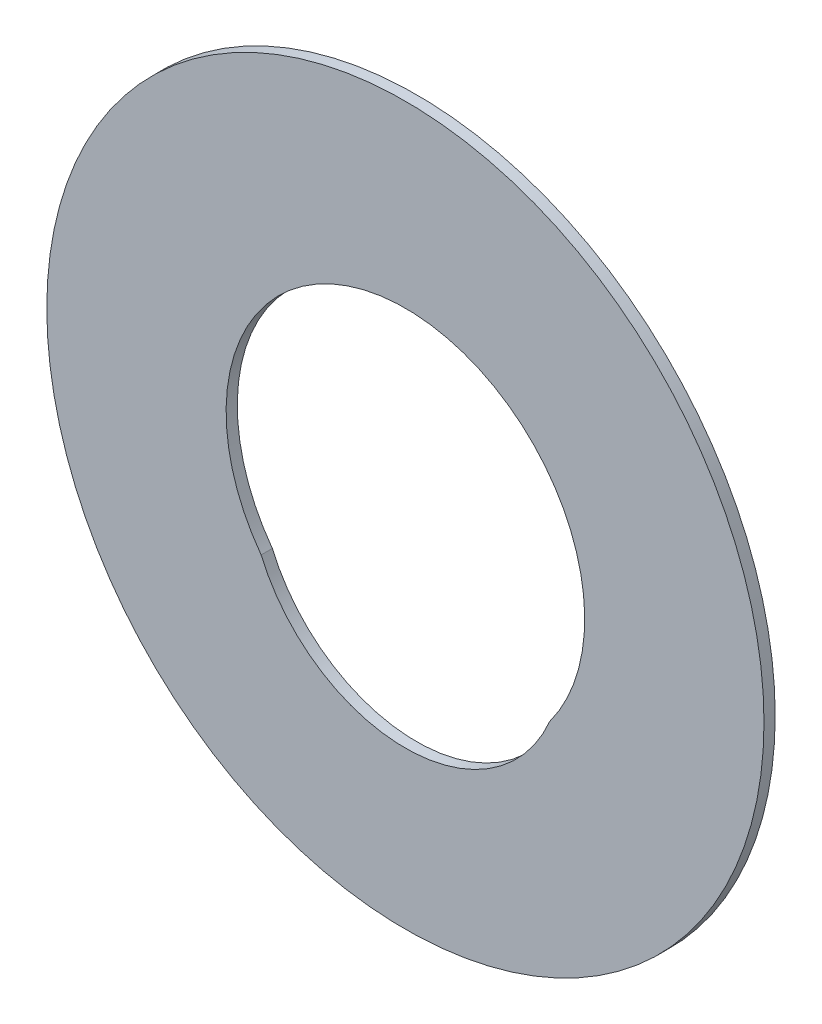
ISO-10303-21;
HEADER;
FILE_DESCRIPTION(('STEP AP214'),'2;1');
FILE_NAME('part.step','',(''),(''),'','','');
FILE_SCHEMA(('AUTOMOTIVE_DESIGN { 1 0 10303 214 1 1 1 1 }'));
ENDSEC;
DATA;
#1=APPLICATION_CONTEXT('core data for automotive mechanical design processes');
#2=APPLICATION_PROTOCOL_DEFINITION('international standard','automotive_design',2000,#1);
#3=PRODUCT_CONTEXT('',#1,'mechanical');
#4=PRODUCT('Part','Part','',(#3));
#5=PRODUCT_RELATED_PRODUCT_CATEGORY('part','',(#4));
#6=PRODUCT_DEFINITION_FORMATION('','',#4);
#7=PRODUCT_DEFINITION_CONTEXT('part definition',#1,'design');
#8=PRODUCT_DEFINITION('design','',#6,#7);
#9=PRODUCT_DEFINITION_SHAPE('','',#8);
#10=(LENGTH_UNIT() NAMED_UNIT(*) SI_UNIT(.MILLI.,.METRE.));
#11=(NAMED_UNIT(*) PLANE_ANGLE_UNIT() SI_UNIT($,.RADIAN.));
#12=(NAMED_UNIT(*) SI_UNIT($,.STERADIAN.) SOLID_ANGLE_UNIT());
#13=UNCERTAINTY_MEASURE_WITH_UNIT(LENGTH_MEASURE(1.E-05),#10,'distance_accuracy_value','');
#14=(GEOMETRIC_REPRESENTATION_CONTEXT(3) GLOBAL_UNCERTAINTY_ASSIGNED_CONTEXT((#13)) GLOBAL_UNIT_ASSIGNED_CONTEXT((#10,
#11,#12)) REPRESENTATION_CONTEXT('',''));
#15=CARTESIAN_POINT('',(0.,0.,0.));
#16=DIRECTION('',(0.,0.,1.));
#17=DIRECTION('',(1.,0.,0.));
#18=AXIS2_PLACEMENT_3D('',#15,#16,#17);
#19=CARTESIAN_POINT('',(0.,0.,0.));
#20=DIRECTION('',(0.,0.,1.));
#21=DIRECTION('',(1.,0.,0.));
#22=AXIS2_PLACEMENT_3D('',#19,#20,#21);
#23=PLANE('',#22);
#24=CARTESIAN_POINT('',(0.,0.,0.));
#25=DIRECTION('',(0.,0.,-1.));
#26=DIRECTION('',(-1.,0.,0.));
#27=AXIS2_PLACEMENT_3D('',#24,#25,#26);
#28=CIRCLE('',#27,4.);
#29=CARTESIAN_POINT('',(3.21859829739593,-2.375,0.));
#30=VERTEX_POINT('',#29);
#31=CARTESIAN_POINT('',(-3.21859829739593,-2.375,0.));
#32=VERTEX_POINT('',#31);
#33=EDGE_CURVE('E44',#30,#32,#28,.F.);
#34=ORIENTED_EDGE('',*,*,#33,.T.);
#35=CARTESIAN_POINT('',(0.,-1.,0.));
#36=DIRECTION('',(0.,0.,1.));
#37=DIRECTION('',(1.,0.,0.));
#38=AXIS2_PLACEMENT_3D('',#35,#36,#37);
#39=CIRCLE('',#38,3.5);
#40=EDGE_CURVE('E20',#32,#30,#39,.T.);
#41=ORIENTED_EDGE('',*,*,#40,.T.);
#42=EDGE_LOOP('',(#34,#41));
#43=FACE_BOUND('',#42,.T.);
#44=CARTESIAN_POINT('',(0.,0.,0.));
#45=DIRECTION('',(0.,0.,-1.));
#46=DIRECTION('',(-1.,0.,0.));
#47=AXIS2_PLACEMENT_3D('',#44,#45,#46);
#48=CIRCLE('',#47,8.);
#49=CARTESIAN_POINT('',(-8.,0.,0.));
#50=VERTEX_POINT('',#49);
#51=EDGE_CURVE('E55',#50,#50,#48,.F.);
#52=ORIENTED_EDGE('',*,*,#51,.F.);
#53=EDGE_LOOP('',(#52));
#54=FACE_BOUND('',#53,.T.);
#55=ADVANCED_FACE('F17',(#43,#54),#23,.F.);
#56=CARTESIAN_POINT('',(0.,-1.,0.));
#57=DIRECTION('',(0.,0.,1.));
#58=DIRECTION('',(1.,0.,0.));
#59=AXIS2_PLACEMENT_3D('',#56,#57,#58);
#60=CYLINDRICAL_SURFACE('',#59,3.5);
#61=CARTESIAN_POINT('',(0.,-1.,0.25));
#62=DIRECTION('',(0.,0.,1.));
#63=DIRECTION('',(1.,0.,0.));
#64=AXIS2_PLACEMENT_3D('',#61,#62,#63);
#65=CIRCLE('',#64,3.5);
#66=CARTESIAN_POINT('',(3.21859829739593,-2.375,0.25));
#67=VERTEX_POINT('',#66);
#68=CARTESIAN_POINT('',(-3.21859829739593,-2.375,0.25));
#69=VERTEX_POINT('',#68);
#70=EDGE_CURVE('E51',#67,#69,#65,.F.);
#71=ORIENTED_EDGE('',*,*,#70,.F.);
#72=DIRECTION('',(0.,0.,-1.));
#73=VECTOR('',#72,1.);
#74=CARTESIAN_POINT('',(3.21859829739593,-2.375,0.25));
#75=LINE('',#74,#73);
#76=EDGE_CURVE('E48',#67,#30,#75,.T.);
#77=ORIENTED_EDGE('',*,*,#76,.T.);
#78=ORIENTED_EDGE('',*,*,#40,.F.);
#79=DIRECTION('',(0.,0.,-1.));
#80=VECTOR('',#79,1.);
#81=CARTESIAN_POINT('',(-3.21859829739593,-2.375,0.25));
#82=LINE('',#81,#80);
#83=EDGE_CURVE('E35',#32,#69,#82,.F.);
#84=ORIENTED_EDGE('',*,*,#83,.T.);
#85=EDGE_LOOP('',(#71,#77,#78,#84));
#86=FACE_BOUND('',#85,.T.);
#87=ADVANCED_FACE('F49',(#86),#60,.F.);
#88=CARTESIAN_POINT('',(0.,0.,0.25));
#89=DIRECTION('',(0.,0.,-1.));
#90=DIRECTION('',(-1.,0.,0.));
#91=AXIS2_PLACEMENT_3D('',#88,#89,#90);
#92=CYLINDRICAL_SURFACE('',#91,4.);
#93=ORIENTED_EDGE('',*,*,#76,.F.);
#94=CARTESIAN_POINT('',(0.,0.,0.25));
#95=DIRECTION('',(0.,0.,-1.));
#96=DIRECTION('',(-1.,0.,0.));
#97=AXIS2_PLACEMENT_3D('',#94,#95,#96);
#98=CIRCLE('',#97,4.);
#99=EDGE_CURVE('E26',#69,#67,#98,.T.);
#100=ORIENTED_EDGE('',*,*,#99,.F.);
#101=ORIENTED_EDGE('',*,*,#83,.F.);
#102=ORIENTED_EDGE('',*,*,#33,.F.);
#103=EDGE_LOOP('',(#93,#100,#101,#102));
#104=FACE_BOUND('',#103,.T.);
#105=ADVANCED_FACE('F54',(#104),#92,.F.);
#106=CARTESIAN_POINT('',(0.,0.,0.25));
#107=DIRECTION('',(0.,0.,-1.));
#108=DIRECTION('',(-1.,0.,0.));
#109=AXIS2_PLACEMENT_3D('',#106,#107,#108);
#110=CYLINDRICAL_SURFACE('',#109,8.);
#111=ORIENTED_EDGE('',*,*,#51,.T.);
#112=EDGE_LOOP('',(#111));
#113=FACE_BOUND('',#112,.T.);
#114=CARTESIAN_POINT('',(0.,0.,0.25));
#115=DIRECTION('',(0.,0.,-1.));
#116=DIRECTION('',(-1.,0.,0.));
#117=AXIS2_PLACEMENT_3D('',#114,#115,#116);
#118=CIRCLE('',#117,8.);
#119=CARTESIAN_POINT('',(-8.,0.,0.25));
#120=VERTEX_POINT('',#119);
#121=EDGE_CURVE('E11',#120,#120,#118,.F.);
#122=ORIENTED_EDGE('',*,*,#121,.F.);
#123=EDGE_LOOP('',(#122));
#124=FACE_BOUND('',#123,.T.);
#125=ADVANCED_FACE('F64',(#113,#124),#110,.T.);
#126=CARTESIAN_POINT('',(0.,0.,0.25));
#127=DIRECTION('',(0.,0.,1.));
#128=DIRECTION('',(1.,0.,0.));
#129=AXIS2_PLACEMENT_3D('',#126,#127,#128);
#130=PLANE('',#129);
#131=ORIENTED_EDGE('',*,*,#121,.T.);
#132=EDGE_LOOP('',(#131));
#133=FACE_BOUND('',#132,.T.);
#134=ORIENTED_EDGE('',*,*,#99,.T.);
#135=ORIENTED_EDGE('',*,*,#70,.T.);
#136=EDGE_LOOP('',(#134,#135));
#137=FACE_BOUND('',#136,.T.);
#138=ADVANCED_FACE('F62',(#133,#137),#130,.T.);
#139=CLOSED_SHELL('',(#55,#87,#105,#125,#138));
#140=MANIFOLD_SOLID_BREP('B1',#139);
#141=ADVANCED_BREP_SHAPE_REPRESENTATION('',(#18,#140),#14);
#142=SHAPE_DEFINITION_REPRESENTATION(#9,#141);
ENDSEC;
END-ISO-10303-21;
